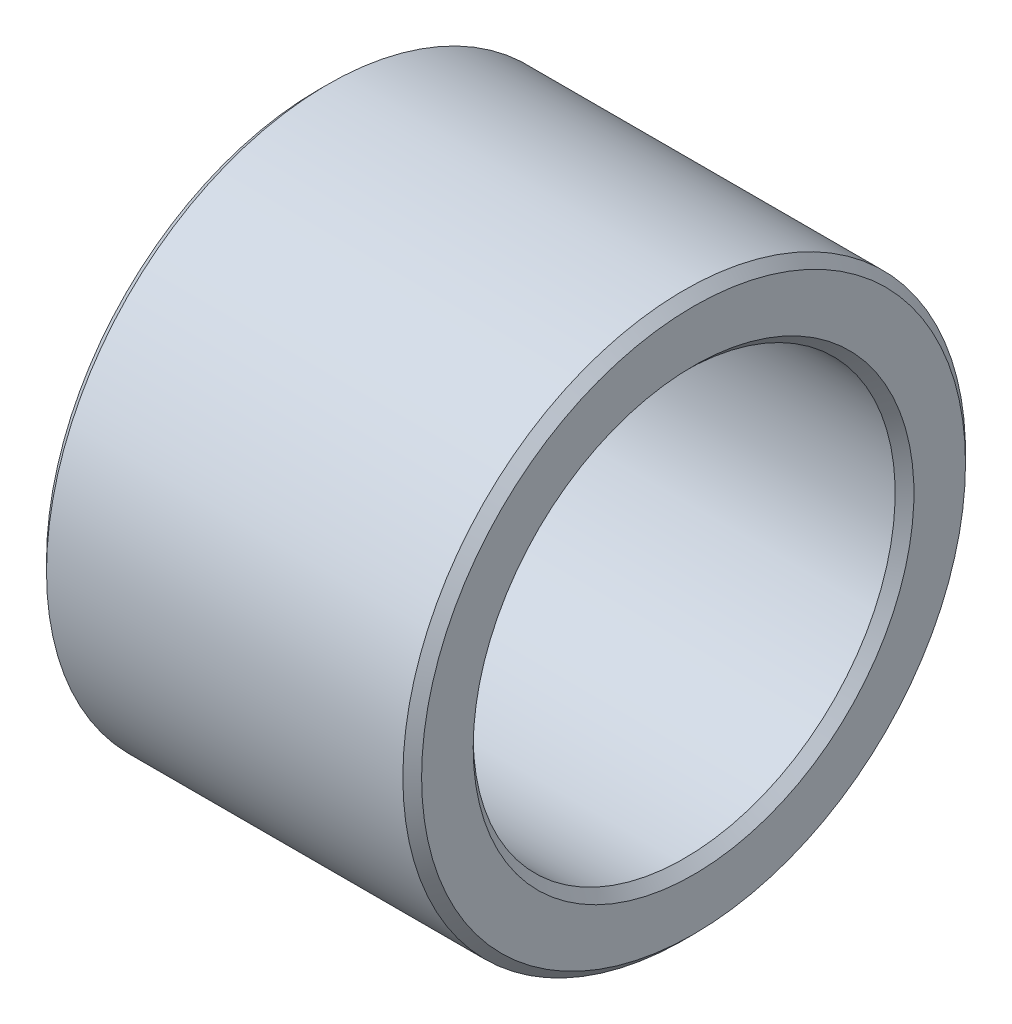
from build123d import *


with BuildPart() as part:
    # Esquisse1 → Base-R_volution (revolve)
    with BuildSketch(Plane.XY, mode=Mode.PRIVATE) as base_r_volution_sk:
        Polygon((0, 9.4), (0, 11.6), (0.4, 12), (15.6, 12), (16, 11.6), (16, 9.4), (15.6, 9), (0.4, 9), align=None)
    revolve(base_r_volution_sk.sketch.rotate(Axis((0, 0, 0), (1, 0, 0)), 90), axis=Axis((0, 0, 0), (1, 0, 0)))


solid = part.part
